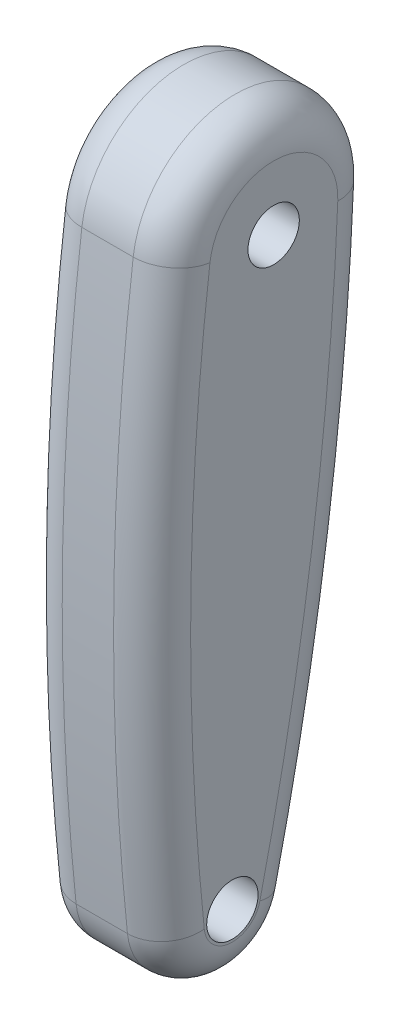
ISO-10303-21;
HEADER;
FILE_DESCRIPTION(('STEP AP214'),'2;1');
FILE_NAME('part.step','',(''),(''),'','','');
FILE_SCHEMA(('AUTOMOTIVE_DESIGN { 1 0 10303 214 1 1 1 1 }'));
ENDSEC;
DATA;
#1=APPLICATION_CONTEXT('core data for automotive mechanical design processes');
#2=APPLICATION_PROTOCOL_DEFINITION('international standard','automotive_design',2000,#1);
#3=PRODUCT_CONTEXT('',#1,'mechanical');
#4=PRODUCT('Part','Part','',(#3));
#5=PRODUCT_RELATED_PRODUCT_CATEGORY('part','',(#4));
#6=PRODUCT_DEFINITION_FORMATION('','',#4);
#7=PRODUCT_DEFINITION_CONTEXT('part definition',#1,'design');
#8=PRODUCT_DEFINITION('design','',#6,#7);
#9=PRODUCT_DEFINITION_SHAPE('','',#8);
#10=(LENGTH_UNIT() NAMED_UNIT(*) SI_UNIT(.MILLI.,.METRE.));
#11=(NAMED_UNIT(*) PLANE_ANGLE_UNIT() SI_UNIT($,.RADIAN.));
#12=(NAMED_UNIT(*) SI_UNIT($,.STERADIAN.) SOLID_ANGLE_UNIT());
#13=UNCERTAINTY_MEASURE_WITH_UNIT(LENGTH_MEASURE(1.E-05),#10,'distance_accuracy_value','');
#14=(GEOMETRIC_REPRESENTATION_CONTEXT(3) GLOBAL_UNCERTAINTY_ASSIGNED_CONTEXT((#13)) GLOBAL_UNIT_ASSIGNED_CONTEXT((#10,
#11,#12)) REPRESENTATION_CONTEXT('',''));
#15=CARTESIAN_POINT('',(0.,0.,0.));
#16=DIRECTION('',(0.,0.,1.));
#17=DIRECTION('',(1.,0.,0.));
#18=AXIS2_PLACEMENT_3D('',#15,#16,#17);
#19=CARTESIAN_POINT('',(222.25,-234.840307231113,-1250.38847130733));
#20=DIRECTION('',(1.,0.,0.));
#21=DIRECTION('',(0.,0.,-1.));
#22=AXIS2_PLACEMENT_3D('',#19,#20,#21);
#23=CYLINDRICAL_SURFACE('',#22,1270.);
#24=DIRECTION('',(1.,0.,0.));
#25=VECTOR('',#24,1.);
#26=CARTESIAN_POINT('',(222.25,-366.573375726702,12.7609255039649));
#27=LINE('',#26,#25);
#28=CARTESIAN_POINT('',(241.3,-366.573375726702,12.7609255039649));
#29=VERTEX_POINT('',#28);
#30=CARTESIAN_POINT('',(266.7,-366.573375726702,12.7609255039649));
#31=VERTEX_POINT('',#30);
#32=EDGE_CURVE('E141',#29,#31,#27,.T.);
#33=ORIENTED_EDGE('',*,*,#32,.T.);
#34=CARTESIAN_POINT('',(266.7,-234.840307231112,-1250.38847130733));
#35=DIRECTION('',(-1.,0.,0.));
#36=DIRECTION('',(0.,0.,1.));
#37=AXIS2_PLACEMENT_3D('',#34,#35,#36);
#38=CIRCLE('',#37,1270.);
#39=CARTESIAN_POINT('',(266.7,-78.2306079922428,9.91839692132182));
#40=VERTEX_POINT('',#39);
#41=EDGE_CURVE('E162',#31,#40,#38,.T.);
#42=ORIENTED_EDGE('',*,*,#41,.T.);
#43=DIRECTION('',(1.,0.,0.));
#44=VECTOR('',#43,1.);
#45=CARTESIAN_POINT('',(222.25,-78.2306079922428,9.91839692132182));
#46=LINE('',#45,#44);
#47=CARTESIAN_POINT('',(241.3,-78.2306079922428,9.91839692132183));
#48=VERTEX_POINT('',#47);
#49=EDGE_CURVE('E115',#48,#40,#46,.T.);
#50=ORIENTED_EDGE('',*,*,#49,.F.);
#51=CARTESIAN_POINT('',(241.3,-234.840307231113,-1250.38847130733));
#52=DIRECTION('',(-1.,0.,0.));
#53=DIRECTION('',(0.,0.,1.));
#54=AXIS2_PLACEMENT_3D('',#51,#52,#53);
#55=CIRCLE('',#54,1270.);
#56=EDGE_CURVE('E160',#48,#29,#55,.F.);
#57=ORIENTED_EDGE('',*,*,#56,.T.);
#58=EDGE_LOOP('',(#33,#42,#50,#57));
#59=FACE_BOUND('',#58,.T.);
#60=ADVANCED_FACE('F31',(#59),#23,.T.);
#61=CARTESIAN_POINT('',(222.25,-84.4949959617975,-40.4938778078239));
#62=DIRECTION('',(1.,0.,0.));
#63=DIRECTION('',(0.,0.,-1.));
#64=AXIS2_PLACEMENT_3D('',#61,#62,#63);
#65=CYLINDRICAL_SURFACE('',#64,50.7999999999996);
#66=ORIENTED_EDGE('',*,*,#49,.T.);
#67=CARTESIAN_POINT('',(266.7,-84.4949959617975,-40.4938778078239));
#68=DIRECTION('',(-1.,0.,0.));
#69=DIRECTION('',(0.,0.,1.));
#70=AXIS2_PLACEMENT_3D('',#67,#68,#69);
#71=CIRCLE('',#70,50.7999999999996);
#72=CARTESIAN_POINT('',(266.7,-86.6438502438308,-91.2484088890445));
#73=VERTEX_POINT('',#72);
#74=EDGE_CURVE('E114',#40,#73,#71,.T.);
#75=ORIENTED_EDGE('',*,*,#74,.T.);
#76=DIRECTION('',(1.,0.,0.));
#77=VECTOR('',#76,1.);
#78=CARTESIAN_POINT('',(222.25,-86.6438502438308,-91.2484088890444));
#79=LINE('',#78,#77);
#80=CARTESIAN_POINT('',(241.3,-86.6438502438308,-91.2484088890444));
#81=VERTEX_POINT('',#80);
#82=EDGE_CURVE('E97',#81,#73,#79,.T.);
#83=ORIENTED_EDGE('',*,*,#82,.F.);
#84=CARTESIAN_POINT('',(241.3,-84.4949959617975,-40.4938778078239));
#85=DIRECTION('',(-1.,0.,0.));
#86=DIRECTION('',(0.,0.,1.));
#87=AXIS2_PLACEMENT_3D('',#84,#85,#86);
#88=CIRCLE('',#87,50.7999999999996);
#89=EDGE_CURVE('E111',#81,#48,#88,.F.);
#90=ORIENTED_EDGE('',*,*,#89,.T.);
#91=EDGE_LOOP('',(#66,#75,#83,#90));
#92=FACE_BOUND('',#91,.T.);
#93=ADVANCED_FACE('F110',(#92),#65,.T.);
#94=CARTESIAN_POINT('',(222.25,-22.1782217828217,1431.38752354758));
#95=DIRECTION('',(1.,0.,0.));
#96=DIRECTION('',(0.,0.,-1.));
#97=AXIS2_PLACEMENT_3D('',#94,#95,#96);
#98=CYLINDRICAL_SURFACE('',#97,1524.);
#99=ORIENTED_EDGE('',*,*,#82,.T.);
#100=CARTESIAN_POINT('',(266.7,-22.1782217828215,1431.38752354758));
#101=DIRECTION('',(-1.,0.,0.));
#102=DIRECTION('',(0.,0.,1.));
#103=AXIS2_PLACEMENT_3D('',#100,#101,#102);
#104=CIRCLE('',#103,1524.);
#105=CARTESIAN_POINT('',(266.7,-370.699612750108,-52.2259166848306));
#106=VERTEX_POINT('',#105);
#107=EDGE_CURVE('E103',#73,#106,#104,.T.);
#108=ORIENTED_EDGE('',*,*,#107,.T.);
#109=DIRECTION('',(1.,0.,0.));
#110=VECTOR('',#109,1.);
#111=CARTESIAN_POINT('',(222.25,-370.699612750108,-52.2259166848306));
#112=LINE('',#111,#110);
#113=CARTESIAN_POINT('',(241.3,-370.699612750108,-52.2259166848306));
#114=VERTEX_POINT('',#113);
#115=EDGE_CURVE('E99',#114,#106,#112,.T.);
#116=ORIENTED_EDGE('',*,*,#115,.F.);
#117=CARTESIAN_POINT('',(241.3,-22.1782217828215,1431.38752354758));
#118=DIRECTION('',(-1.,0.,0.));
#119=DIRECTION('',(0.,0.,1.));
#120=AXIS2_PLACEMENT_3D('',#117,#118,#119);
#121=CIRCLE('',#120,1524.);
#122=EDGE_CURVE('E94',#114,#81,#121,.F.);
#123=ORIENTED_EDGE('',*,*,#122,.T.);
#124=EDGE_LOOP('',(#99,#108,#116,#123));
#125=FACE_BOUND('',#124,.T.);
#126=ADVANCED_FACE('F96',(#125),#98,.T.);
#127=CARTESIAN_POINT('',(222.25,-363.148315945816,-20.0809588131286));
#128=DIRECTION('',(1.,0.,0.));
#129=DIRECTION('',(0.,0.,-1.));
#130=AXIS2_PLACEMENT_3D('',#127,#128,#129);
#131=CYLINDRICAL_SURFACE('',#130,33.0199999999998);
#132=ORIENTED_EDGE('',*,*,#115,.T.);
#133=CARTESIAN_POINT('',(266.7,-363.148315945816,-20.0809588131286));
#134=DIRECTION('',(-1.,0.,0.));
#135=DIRECTION('',(0.,0.,1.));
#136=AXIS2_PLACEMENT_3D('',#133,#134,#135);
#137=CIRCLE('',#136,33.0199999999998);
#138=EDGE_CURVE('E158',#106,#31,#137,.T.);
#139=ORIENTED_EDGE('',*,*,#138,.T.);
#140=ORIENTED_EDGE('',*,*,#32,.F.);
#141=CARTESIAN_POINT('',(241.3,-363.148315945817,-20.0809588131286));
#142=DIRECTION('',(-1.,0.,0.));
#143=DIRECTION('',(0.,0.,1.));
#144=AXIS2_PLACEMENT_3D('',#141,#142,#143);
#145=CIRCLE('',#144,33.0199999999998);
#146=EDGE_CURVE('E156',#29,#114,#145,.F.);
#147=ORIENTED_EDGE('',*,*,#146,.T.);
#148=EDGE_LOOP('',(#132,#139,#140,#147));
#149=FACE_BOUND('',#148,.T.);
#150=ADVANCED_FACE('F178',(#149),#131,.T.);
#151=CARTESIAN_POINT('',(222.25,-159.667651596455,-645.441174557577));
#152=DIRECTION('',(-1.,0.,0.));
#153=DIRECTION('',(0.,0.,1.));
#154=AXIS2_PLACEMENT_3D('',#151,#152,#153);
#155=PLANE('',#154);
#156=CARTESIAN_POINT('',(222.25,-363.148315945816,-20.0809588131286));
#157=DIRECTION('',(1.,0.,0.));
#158=DIRECTION('',(0.,1.,0.));
#159=AXIS2_PLACEMENT_3D('',#156,#157,#158);
#160=CIRCLE('',#159,12.7);
#161=CARTESIAN_POINT('',(222.25,-350.448315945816,-20.0809588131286));
#162=VERTEX_POINT('',#161);
#163=EDGE_CURVE('E190',#162,#162,#160,.T.);
#164=ORIENTED_EDGE('',*,*,#163,.T.);
#165=EDGE_LOOP('',(#164));
#166=FACE_BOUND('',#165,.T.);
#167=CARTESIAN_POINT('',(222.25,-84.4949959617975,-40.4938778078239));
#168=DIRECTION('',(1.,0.,0.));
#169=DIRECTION('',(0.,1.,0.));
#170=AXIS2_PLACEMENT_3D('',#167,#168,#169);
#171=CIRCLE('',#170,12.7);
#172=CARTESIAN_POINT('',(222.25,-71.7949959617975,-40.4938778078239));
#173=VERTEX_POINT('',#172);
#174=EDGE_CURVE('E182',#173,#173,#171,.T.);
#175=ORIENTED_EDGE('',*,*,#174,.T.);
#176=EDGE_LOOP('',(#175));
#177=FACE_BOUND('',#176,.T.);
#178=CARTESIAN_POINT('',(222.25,-22.1782217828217,1431.38752354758));
#179=DIRECTION('',(-1.,0.,0.));
#180=DIRECTION('',(0.,0.,1.));
#181=AXIS2_PLACEMENT_3D('',#178,#179,#180);
#182=CIRCLE('',#181,1504.95);
#183=CARTESIAN_POINT('',(222.25,-85.8380298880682,-72.2154597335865));
#184=VERTEX_POINT('',#183);
#185=CARTESIAN_POINT('',(222.25,-366.343095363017,-33.6807486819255));
#186=VERTEX_POINT('',#185);
#187=EDGE_CURVE('E38',#184,#186,#182,.T.);
#188=ORIENTED_EDGE('',*,*,#187,.T.);
#189=CARTESIAN_POINT('',(222.25,-363.148315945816,-20.0809588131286));
#190=DIRECTION('',(-1.,0.,0.));
#191=DIRECTION('',(0.,0.,1.));
#192=AXIS2_PLACEMENT_3D('',#189,#190,#191);
#193=CIRCLE('',#192,13.9699999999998);
#194=CARTESIAN_POINT('',(222.25,-364.597379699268,-6.18631544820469));
#195=VERTEX_POINT('',#194);
#196=EDGE_CURVE('E11',#186,#195,#193,.T.);
#197=ORIENTED_EDGE('',*,*,#196,.T.);
#198=CARTESIAN_POINT('',(222.25,-234.840307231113,-1250.38847130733));
#199=DIRECTION('',(-1.,0.,0.));
#200=DIRECTION('',(0.,0.,1.));
#201=AXIS2_PLACEMENT_3D('',#198,#199,#200);
#202=CIRCLE('',#201,1250.95);
#203=CARTESIAN_POINT('',(222.25,-80.5797534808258,-8.98620610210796));
#204=VERTEX_POINT('',#203);
#205=EDGE_CURVE('E164',#195,#204,#202,.T.);
#206=ORIENTED_EDGE('',*,*,#205,.T.);
#207=CARTESIAN_POINT('',(222.25,-84.4949959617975,-40.4938778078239));
#208=DIRECTION('',(-1.,0.,0.));
#209=DIRECTION('',(0.,0.,1.));
#210=AXIS2_PLACEMENT_3D('',#207,#208,#209);
#211=CIRCLE('',#210,31.7499999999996);
#212=EDGE_CURVE('E48',#204,#184,#211,.T.);
#213=ORIENTED_EDGE('',*,*,#212,.T.);
#214=EDGE_LOOP('',(#188,#197,#206,#213));
#215=FACE_BOUND('',#214,.T.);
#216=ADVANCED_FACE('F167',(#166,#177,#215),#155,.T.);
#217=CARTESIAN_POINT('',(285.75,-159.667651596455,-645.441174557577));
#218=DIRECTION('',(-1.,0.,0.));
#219=DIRECTION('',(0.,0.,1.));
#220=AXIS2_PLACEMENT_3D('',#217,#218,#219);
#221=PLANE('',#220);
#222=CARTESIAN_POINT('',(285.75,-363.148315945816,-20.0809588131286));
#223=DIRECTION('',(1.,0.,0.));
#224=DIRECTION('',(0.,1.,0.));
#225=AXIS2_PLACEMENT_3D('',#222,#223,#224);
#226=CIRCLE('',#225,12.7);
#227=CARTESIAN_POINT('',(285.75,-350.448315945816,-20.0809588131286));
#228=VERTEX_POINT('',#227);
#229=EDGE_CURVE('E193',#228,#228,#226,.T.);
#230=ORIENTED_EDGE('',*,*,#229,.F.);
#231=EDGE_LOOP('',(#230));
#232=FACE_BOUND('',#231,.T.);
#233=CARTESIAN_POINT('',(285.75,-84.4949959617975,-40.4938778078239));
#234=DIRECTION('',(1.,0.,0.));
#235=DIRECTION('',(0.,1.,0.));
#236=AXIS2_PLACEMENT_3D('',#233,#234,#235);
#237=CIRCLE('',#236,12.7);
#238=CARTESIAN_POINT('',(285.75,-71.7949959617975,-40.4938778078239));
#239=VERTEX_POINT('',#238);
#240=EDGE_CURVE('E187',#239,#239,#237,.T.);
#241=ORIENTED_EDGE('',*,*,#240,.F.);
#242=EDGE_LOOP('',(#241));
#243=FACE_BOUND('',#242,.T.);
#244=CARTESIAN_POINT('',(285.75,-22.1782217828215,1431.38752354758));
#245=DIRECTION('',(-1.,0.,0.));
#246=DIRECTION('',(0.,0.,1.));
#247=AXIS2_PLACEMENT_3D('',#244,#245,#246);
#248=CIRCLE('',#247,1504.95);
#249=CARTESIAN_POINT('',(285.75,-366.343095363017,-33.6807486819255));
#250=VERTEX_POINT('',#249);
#251=CARTESIAN_POINT('',(285.75,-85.8380298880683,-72.2154597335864));
#252=VERTEX_POINT('',#251);
#253=EDGE_CURVE('E151',#250,#252,#248,.F.);
#254=ORIENTED_EDGE('',*,*,#253,.T.);
#255=CARTESIAN_POINT('',(285.75,-84.4949959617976,-40.4938778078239));
#256=DIRECTION('',(-1.,0.,0.));
#257=DIRECTION('',(0.,0.,1.));
#258=AXIS2_PLACEMENT_3D('',#255,#256,#257);
#259=CIRCLE('',#258,31.7499999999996);
#260=CARTESIAN_POINT('',(285.75,-80.5797534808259,-8.98620610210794));
#261=VERTEX_POINT('',#260);
#262=EDGE_CURVE('E104',#252,#261,#259,.F.);
#263=ORIENTED_EDGE('',*,*,#262,.T.);
#264=CARTESIAN_POINT('',(285.75,-234.840307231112,-1250.38847130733));
#265=DIRECTION('',(-1.,0.,0.));
#266=DIRECTION('',(0.,0.,1.));
#267=AXIS2_PLACEMENT_3D('',#264,#265,#266);
#268=CIRCLE('',#267,1250.95);
#269=CARTESIAN_POINT('',(285.75,-364.597379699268,-6.18631544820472));
#270=VERTEX_POINT('',#269);
#271=EDGE_CURVE('E147',#261,#270,#268,.F.);
#272=ORIENTED_EDGE('',*,*,#271,.T.);
#273=CARTESIAN_POINT('',(285.75,-363.148315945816,-20.0809588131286));
#274=DIRECTION('',(-1.,0.,0.));
#275=DIRECTION('',(0.,0.,1.));
#276=AXIS2_PLACEMENT_3D('',#273,#274,#275);
#277=CIRCLE('',#276,13.9699999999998);
#278=EDGE_CURVE('E149',#270,#250,#277,.F.);
#279=ORIENTED_EDGE('',*,*,#278,.T.);
#280=EDGE_LOOP('',(#254,#263,#272,#279));
#281=FACE_BOUND('',#280,.T.);
#282=ADVANCED_FACE('F199',(#232,#243,#281),#221,.F.);
#283=CARTESIAN_POINT('',(266.7,-363.148315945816,-20.0809588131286));
#284=DIRECTION('',(-1.,0.,0.));
#285=DIRECTION('',(0.,0.,1.));
#286=AXIS2_PLACEMENT_3D('',#283,#284,#285);
#287=DEGENERATE_TOROIDAL_SURFACE('',#286,13.9699999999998,19.05,.T.);
#288=CARTESIAN_POINT('',(266.7,-366.343095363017,-33.6807486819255));
#289=DIRECTION('',(0.,0.973499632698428,-0.228688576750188));
#290=DIRECTION('',(0.,0.228688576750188,0.973499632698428));
#291=AXIS2_PLACEMENT_3D('',#288,#289,#290);
#292=CIRCLE('',#291,19.05);
#293=EDGE_CURVE('E135',#250,#106,#292,.T.);
#294=ORIENTED_EDGE('',*,*,#293,.F.);
#295=ORIENTED_EDGE('',*,*,#278,.F.);
#296=CARTESIAN_POINT('',(266.7,-364.597379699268,-6.18631544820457));
#297=DIRECTION('',(0.,0.994605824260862,0.103726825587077));
#298=DIRECTION('',(0.,-0.103726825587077,0.994605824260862));
#299=AXIS2_PLACEMENT_3D('',#296,#297,#298);
#300=CIRCLE('',#299,19.05);
#301=EDGE_CURVE('E138',#31,#270,#300,.T.);
#302=ORIENTED_EDGE('',*,*,#301,.F.);
#303=ORIENTED_EDGE('',*,*,#138,.F.);
#304=EDGE_LOOP('',(#294,#295,#302,#303));
#305=FACE_BOUND('',#304,.T.);
#306=ADVANCED_FACE('F202',(#305),#287,.T.);
#307=CARTESIAN_POINT('',(266.7,-234.840307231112,-1250.38847130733));
#308=DIRECTION('',(-1.,0.,0.));
#309=DIRECTION('',(0.,0.,1.));
#310=AXIS2_PLACEMENT_3D('',#307,#308,#309);
#311=TOROIDAL_SURFACE('',#310,1250.95,19.05);
#312=ORIENTED_EDGE('',*,*,#301,.T.);
#313=ORIENTED_EDGE('',*,*,#271,.F.);
#314=CARTESIAN_POINT('',(266.7,-80.5797534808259,-8.98620610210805));
#315=DIRECTION('',(0.,0.992367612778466,-0.123314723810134));
#316=DIRECTION('',(0.,0.123314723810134,0.992367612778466));
#317=AXIS2_PLACEMENT_3D('',#314,#315,#316);
#318=CIRCLE('',#317,19.05);
#319=EDGE_CURVE('E128',#40,#261,#318,.T.);
#320=ORIENTED_EDGE('',*,*,#319,.F.);
#321=ORIENTED_EDGE('',*,*,#41,.F.);
#322=EDGE_LOOP('',(#312,#313,#320,#321));
#323=FACE_BOUND('',#322,.T.);
#324=ADVANCED_FACE('F221',(#323),#311,.T.);
#325=CARTESIAN_POINT('',(266.7,-22.1782217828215,1431.38752354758));
#326=DIRECTION('',(-1.,0.,0.));
#327=DIRECTION('',(0.,0.,1.));
#328=AXIS2_PLACEMENT_3D('',#325,#326,#327);
#329=TOROIDAL_SURFACE('',#328,1504.95,19.05);
#330=ORIENTED_EDGE('',*,*,#293,.T.);
#331=ORIENTED_EDGE('',*,*,#107,.F.);
#332=CARTESIAN_POINT('',(266.7,-85.8380298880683,-72.2154597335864));
#333=DIRECTION('',(0.,0.999104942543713,-0.0423002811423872));
#334=DIRECTION('',(0.,0.0423002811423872,0.999104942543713));
#335=AXIS2_PLACEMENT_3D('',#332,#333,#334);
#336=CIRCLE('',#335,19.05);
#337=EDGE_CURVE('E126',#252,#73,#336,.T.);
#338=ORIENTED_EDGE('',*,*,#337,.F.);
#339=ORIENTED_EDGE('',*,*,#253,.F.);
#340=EDGE_LOOP('',(#330,#331,#338,#339));
#341=FACE_BOUND('',#340,.T.);
#342=ADVANCED_FACE('F217',(#341),#329,.T.);
#343=CARTESIAN_POINT('',(266.7,-84.4949959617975,-40.4938778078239));
#344=DIRECTION('',(-1.,0.,0.));
#345=DIRECTION('',(0.,0.,1.));
#346=AXIS2_PLACEMENT_3D('',#343,#344,#345);
#347=TOROIDAL_SURFACE('',#346,31.7499999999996,19.05);
#348=ORIENTED_EDGE('',*,*,#319,.T.);
#349=ORIENTED_EDGE('',*,*,#262,.F.);
#350=ORIENTED_EDGE('',*,*,#337,.T.);
#351=ORIENTED_EDGE('',*,*,#74,.F.);
#352=EDGE_LOOP('',(#348,#349,#350,#351));
#353=FACE_BOUND('',#352,.T.);
#354=ADVANCED_FACE('F213',(#353),#347,.T.);
#355=CARTESIAN_POINT('',(241.3,-84.4949959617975,-40.4938778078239));
#356=DIRECTION('',(-1.,0.,0.));
#357=DIRECTION('',(0.,0.,1.));
#358=AXIS2_PLACEMENT_3D('',#355,#356,#357);
#359=TOROIDAL_SURFACE('',#358,31.7499999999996,19.05);
#360=CARTESIAN_POINT('',(241.3,-80.5797534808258,-8.98620610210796));
#361=DIRECTION('',(0.,-0.992367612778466,0.123314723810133));
#362=DIRECTION('',(0.,-0.123314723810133,-0.992367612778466));
#363=AXIS2_PLACEMENT_3D('',#360,#361,#362);
#364=CIRCLE('',#363,19.05);
#365=EDGE_CURVE('E122',#48,#204,#364,.T.);
#366=ORIENTED_EDGE('',*,*,#365,.F.);
#367=ORIENTED_EDGE('',*,*,#89,.F.);
#368=CARTESIAN_POINT('',(241.3,-85.8380298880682,-72.2154597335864));
#369=DIRECTION('',(0.,-0.999104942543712,0.0423002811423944));
#370=DIRECTION('',(0.,-0.0423002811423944,-0.999104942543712));
#371=AXIS2_PLACEMENT_3D('',#368,#369,#370);
#372=CIRCLE('',#371,19.05);
#373=EDGE_CURVE('E120',#184,#81,#372,.T.);
#374=ORIENTED_EDGE('',*,*,#373,.F.);
#375=ORIENTED_EDGE('',*,*,#212,.F.);
#376=EDGE_LOOP('',(#366,#367,#374,#375));
#377=FACE_BOUND('',#376,.T.);
#378=ADVANCED_FACE('F119',(#377),#359,.T.);
#379=CARTESIAN_POINT('',(241.3,-22.1782217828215,1431.38752354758));
#380=DIRECTION('',(-1.,0.,0.));
#381=DIRECTION('',(0.,0.,1.));
#382=AXIS2_PLACEMENT_3D('',#379,#380,#381);
#383=TOROIDAL_SURFACE('',#382,1504.95,19.05);
#384=ORIENTED_EDGE('',*,*,#373,.T.);
#385=ORIENTED_EDGE('',*,*,#122,.F.);
#386=CARTESIAN_POINT('',(241.3,-366.343095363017,-33.6807486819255));
#387=DIRECTION('',(0.,-0.973499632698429,0.228688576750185));
#388=DIRECTION('',(0.,-0.228688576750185,-0.973499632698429));
#389=AXIS2_PLACEMENT_3D('',#386,#387,#388);
#390=CIRCLE('',#389,19.05);
#391=EDGE_CURVE('E130',#186,#114,#390,.T.);
#392=ORIENTED_EDGE('',*,*,#391,.F.);
#393=ORIENTED_EDGE('',*,*,#187,.F.);
#394=EDGE_LOOP('',(#384,#385,#392,#393));
#395=FACE_BOUND('',#394,.T.);
#396=ADVANCED_FACE('F125',(#395),#383,.T.);
#397=CARTESIAN_POINT('',(241.3,-234.840307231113,-1250.38847130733));
#398=DIRECTION('',(-1.,0.,0.));
#399=DIRECTION('',(0.,0.,1.));
#400=AXIS2_PLACEMENT_3D('',#397,#398,#399);
#401=TOROIDAL_SURFACE('',#400,1250.95,19.05);
#402=ORIENTED_EDGE('',*,*,#365,.T.);
#403=ORIENTED_EDGE('',*,*,#205,.F.);
#404=CARTESIAN_POINT('',(241.3,-364.597379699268,-6.18631544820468));
#405=DIRECTION('',(0.,-0.994605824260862,-0.103726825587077));
#406=DIRECTION('',(0.,0.103726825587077,-0.994605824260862));
#407=AXIS2_PLACEMENT_3D('',#404,#405,#406);
#408=CIRCLE('',#407,19.05);
#409=EDGE_CURVE('E172',#29,#195,#408,.T.);
#410=ORIENTED_EDGE('',*,*,#409,.F.);
#411=ORIENTED_EDGE('',*,*,#56,.F.);
#412=EDGE_LOOP('',(#402,#403,#410,#411));
#413=FACE_BOUND('',#412,.T.);
#414=ADVANCED_FACE('F171',(#413),#401,.T.);
#415=CARTESIAN_POINT('',(241.3,-363.148315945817,-20.0809588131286));
#416=DIRECTION('',(-1.,0.,0.));
#417=DIRECTION('',(0.,0.,1.));
#418=AXIS2_PLACEMENT_3D('',#415,#416,#417);
#419=DEGENERATE_TOROIDAL_SURFACE('',#418,13.9699999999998,19.05,.T.);
#420=ORIENTED_EDGE('',*,*,#391,.T.);
#421=ORIENTED_EDGE('',*,*,#146,.F.);
#422=ORIENTED_EDGE('',*,*,#409,.T.);
#423=ORIENTED_EDGE('',*,*,#196,.F.);
#424=EDGE_LOOP('',(#420,#421,#422,#423));
#425=FACE_BOUND('',#424,.T.);
#426=ADVANCED_FACE('F181',(#425),#419,.T.);
#427=CARTESIAN_POINT('',(222.25,-84.4949959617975,-40.4938778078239));
#428=DIRECTION('',(1.,0.,0.));
#429=DIRECTION('',(0.,1.,0.));
#430=AXIS2_PLACEMENT_3D('',#427,#428,#429);
#431=CYLINDRICAL_SURFACE('',#430,12.7);
#432=ORIENTED_EDGE('',*,*,#174,.F.);
#433=EDGE_LOOP('',(#432));
#434=FACE_BOUND('',#433,.T.);
#435=ORIENTED_EDGE('',*,*,#240,.T.);
#436=EDGE_LOOP('',(#435));
#437=FACE_BOUND('',#436,.T.);
#438=ADVANCED_FACE('F249',(#434,#437),#431,.F.);
#439=CARTESIAN_POINT('',(222.25,-363.148315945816,-20.0809588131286));
#440=DIRECTION('',(1.,0.,0.));
#441=DIRECTION('',(0.,1.,0.));
#442=AXIS2_PLACEMENT_3D('',#439,#440,#441);
#443=CYLINDRICAL_SURFACE('',#442,12.7);
#444=ORIENTED_EDGE('',*,*,#163,.F.);
#445=EDGE_LOOP('',(#444));
#446=FACE_BOUND('',#445,.T.);
#447=ORIENTED_EDGE('',*,*,#229,.T.);
#448=EDGE_LOOP('',(#447));
#449=FACE_BOUND('',#448,.T.);
#450=ADVANCED_FACE('F197',(#446,#449),#443,.F.);
#451=CLOSED_SHELL('',(#60,#93,#126,#150,#216,#282,#306,#324,#342,#354,#378,#396,#414,#426,#438,#450));
#452=MANIFOLD_SOLID_BREP('B2',#451);
#453=ADVANCED_BREP_SHAPE_REPRESENTATION('',(#18,#452),#14);
#454=SHAPE_DEFINITION_REPRESENTATION(#9,#453);
ENDSEC;
END-ISO-10303-21;
